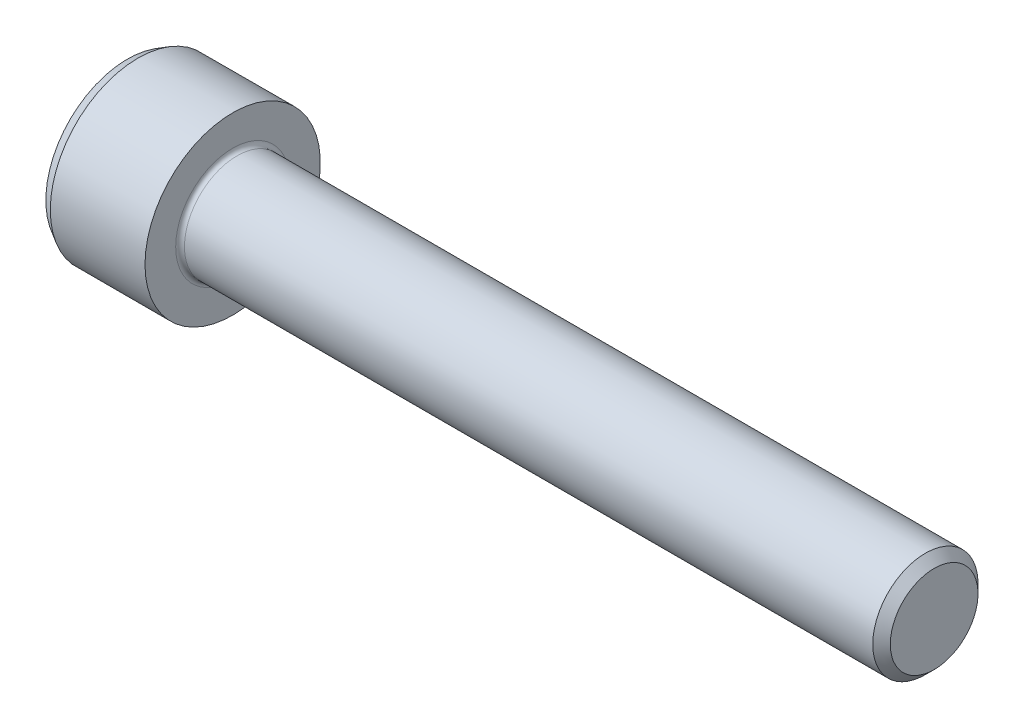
from build123d import *

# Parameters (mm, degrees)
CUT_EXTRUDE1_REACH = 48.54
CHAMFER1_SIZE      = 0.6
CHAMFER1_SIZE2     = 0.346410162
FILLET1_R          = 0.25
CHAMFER2_SIZE      = 0.5


with BuildPart() as part:
    # Sketch1 → Revolve1 (revolve)
    with BuildSketch(Plane.XY, mode=Mode.PRIVATE) as revolve1_sk:
        Polygon((40, 0), (40, 3), (0, 3), (0, 5), (-6, 5), (-6, 0), align=None)
    revolve(revolve1_sk.sketch.rotate(Axis((-24.684449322, 0, 0), (1, 0, 0)), 90), axis=Axis((-24.684449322, 0, 0), (1, 0, 0)))

    # Sketch2 → Cut-Revolve1 (revolve, cut)
    with BuildSketch(Plane.XY):
        Polygon((-6, 2.5), (-3, 2.5), (-1.556624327, 0), (-6, 0), align=None)
    revolve(axis=Axis((-1.556624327, 0, 0), (-1, 0, 0)), mode=Mode.SUBTRACT)

    # Cut-Extrude1: up to this cone (the profile starts inside it)
    cut_extrude1_end = Plane(origin=(-6, 0, 0), z_dir=(-1, 0, 0)).offset(-4.443374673) * Cone(1.732e-06, 105.966051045, 61.179527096, align=(Align.CENTER, Align.CENTER, Align.MIN), mode=Mode.PRIVATE)
    # Sketch3 → Cut-Extrude1 (cut, up to the surface)
    with BuildSketch(Plane(origin=(-6, 0, 0), x_dir=(0, 0, -1), z_dir=(1, 0, 0)), mode=Mode.PRIVATE) as cut_extrude1_sk1:
        Polygon((0, 2.886751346), (-2.5, 1.443375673), (-2.5, -1.443375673), (0, -2.886751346), (2.5, -1.443375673), (2.5, 1.443375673), align=None)
    cut_extrude1_tool1 = extrude(cut_extrude1_sk1.sketch, amount=CUT_EXTRUDE1_REACH, mode=Mode.PRIVATE) & cut_extrude1_end
    add(cut_extrude1_tool1.solids().sort_by_distance((-6, 0, 0))[0], mode=Mode.SUBTRACT)

    # Sketch5 → Cut-Revolve2 (revolve, cut)
    with BuildSketch(Plane.XY, mode=Mode.PRIVATE) as cut_revolve2_sk:
        Polygon((-6, 2.886751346), (-6, 0), (-4.333333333, 0), align=None)
    revolve(cut_revolve2_sk.sketch.rotate(Axis((-6, 0, 0), (1, 0, 0)), 180), axis=Axis((-6, 0, 0), (1, 0, 0)), mode=Mode.SUBTRACT)

    # Chamfer1
    chamfer1_edges = [part.edges().sort_by_distance(p)[0] for p in [
        (-6, 0, -5),
    ]]
    chamfer1_side = [part.faces().sort_by_distance(p)[0] for p in [
        (-3, 0, -5),
    ]]
    chamfer(chamfer1_edges, length=CHAMFER1_SIZE, length2=CHAMFER1_SIZE2, reference=chamfer1_side[0])

    # Fillet1
    fillet1_edges = [part.edges().sort_by_distance(p)[0] for p in [
        (0, 0, -3),
    ]]
    fillet(fillet1_edges, radius=FILLET1_R)

    # Chamfer2
    chamfer2_edges = [part.edges().sort_by_distance(p)[0] for p in [
        (40, 0, -3),
    ]]
    chamfer(chamfer2_edges, length=CHAMFER2_SIZE)


solid = part.part
